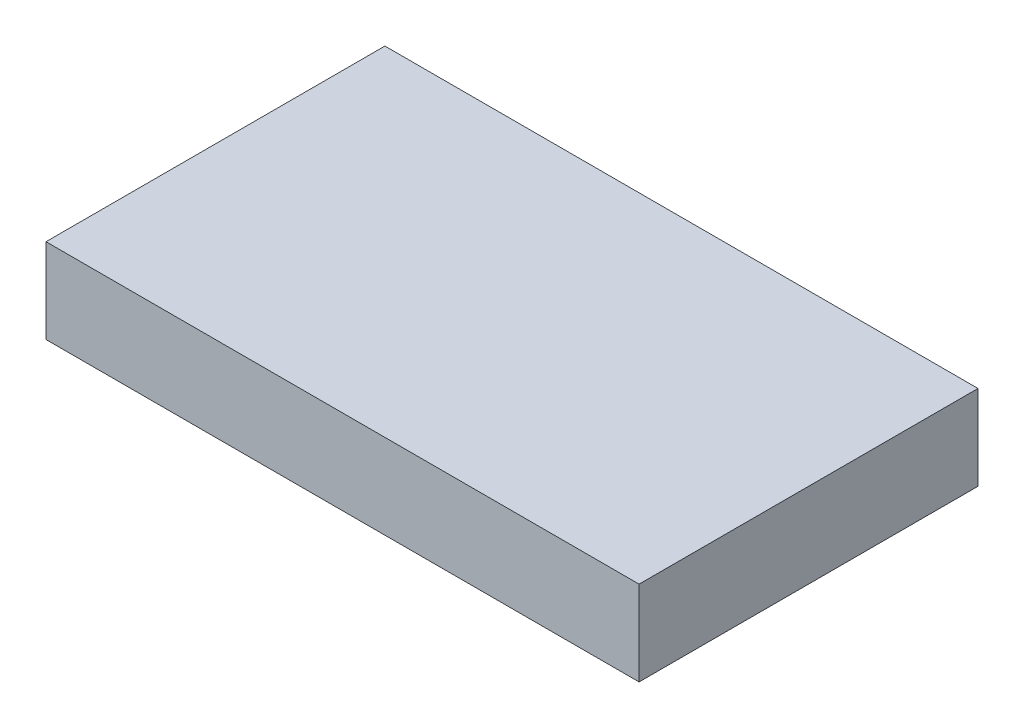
ISO-10303-21;
HEADER;
FILE_DESCRIPTION(('STEP AP214'),'2;1');
FILE_NAME('part.step','',(''),(''),'','','');
FILE_SCHEMA(('AUTOMOTIVE_DESIGN { 1 0 10303 214 1 1 1 1 }'));
ENDSEC;
DATA;
#1=APPLICATION_CONTEXT('core data for automotive mechanical design processes');
#2=APPLICATION_PROTOCOL_DEFINITION('international standard','automotive_design',2000,#1);
#3=PRODUCT_CONTEXT('',#1,'mechanical');
#4=PRODUCT('Part','Part','',(#3));
#5=PRODUCT_RELATED_PRODUCT_CATEGORY('part','',(#4));
#6=PRODUCT_DEFINITION_FORMATION('','',#4);
#7=PRODUCT_DEFINITION_CONTEXT('part definition',#1,'design');
#8=PRODUCT_DEFINITION('design','',#6,#7);
#9=PRODUCT_DEFINITION_SHAPE('','',#8);
#10=(LENGTH_UNIT() NAMED_UNIT(*) SI_UNIT(.MILLI.,.METRE.));
#11=(NAMED_UNIT(*) PLANE_ANGLE_UNIT() SI_UNIT($,.RADIAN.));
#12=(NAMED_UNIT(*) SI_UNIT($,.STERADIAN.) SOLID_ANGLE_UNIT());
#13=UNCERTAINTY_MEASURE_WITH_UNIT(LENGTH_MEASURE(1.E-05),#10,'distance_accuracy_value','');
#14=(GEOMETRIC_REPRESENTATION_CONTEXT(3) GLOBAL_UNCERTAINTY_ASSIGNED_CONTEXT((#13)) GLOBAL_UNIT_ASSIGNED_CONTEXT((#10,
#11,#12)) REPRESENTATION_CONTEXT('',''));
#15=CARTESIAN_POINT('',(0.,0.,0.));
#16=DIRECTION('',(0.,0.,1.));
#17=DIRECTION('',(1.,0.,0.));
#18=AXIS2_PLACEMENT_3D('',#15,#16,#17);
#19=CARTESIAN_POINT('',(-70.,20.,0.));
#20=DIRECTION('',(1.,0.,0.));
#21=DIRECTION('',(0.,0.,-1.));
#22=AXIS2_PLACEMENT_3D('',#19,#20,#21);
#23=PLANE('',#22);
#24=DIRECTION('',(0.,0.,1.));
#25=VECTOR('',#24,1.);
#26=CARTESIAN_POINT('',(-70.,0.,0.));
#27=LINE('',#26,#25);
#28=CARTESIAN_POINT('',(-70.,0.,0.));
#29=VERTEX_POINT('',#28);
#30=CARTESIAN_POINT('',(-70.,0.,80.));
#31=VERTEX_POINT('',#30);
#32=EDGE_CURVE('E94',#29,#31,#27,.T.);
#33=ORIENTED_EDGE('',*,*,#32,.T.);
#34=DIRECTION('',(0.,-1.,0.));
#35=VECTOR('',#34,1.);
#36=CARTESIAN_POINT('',(-70.,20.,80.));
#37=LINE('',#36,#35);
#38=CARTESIAN_POINT('',(-70.,20.,80.));
#39=VERTEX_POINT('',#38);
#40=EDGE_CURVE('E11',#39,#31,#37,.T.);
#41=ORIENTED_EDGE('',*,*,#40,.F.);
#42=DIRECTION('',(0.,0.,1.));
#43=VECTOR('',#42,1.);
#44=CARTESIAN_POINT('',(-70.,20.,0.));
#45=LINE('',#44,#43);
#46=CARTESIAN_POINT('',(-70.,20.,0.));
#47=VERTEX_POINT('',#46);
#48=EDGE_CURVE('E82',#47,#39,#45,.T.);
#49=ORIENTED_EDGE('',*,*,#48,.F.);
#50=DIRECTION('',(0.,-1.,0.));
#51=VECTOR('',#50,1.);
#52=CARTESIAN_POINT('',(-70.,20.,0.));
#53=LINE('',#52,#51);
#54=EDGE_CURVE('E90',#47,#29,#53,.T.);
#55=ORIENTED_EDGE('',*,*,#54,.T.);
#56=EDGE_LOOP('',(#33,#41,#49,#55));
#57=FACE_BOUND('',#56,.T.);
#58=ADVANCED_FACE('F31',(#57),#23,.F.);
#59=CARTESIAN_POINT('',(-70.,20.,80.));
#60=DIRECTION('',(0.,0.,-1.));
#61=DIRECTION('',(-1.,0.,0.));
#62=AXIS2_PLACEMENT_3D('',#59,#60,#61);
#63=PLANE('',#62);
#64=DIRECTION('',(1.,0.,0.));
#65=VECTOR('',#64,1.);
#66=CARTESIAN_POINT('',(-70.,0.,80.));
#67=LINE('',#66,#65);
#68=CARTESIAN_POINT('',(70.,0.,80.));
#69=VERTEX_POINT('',#68);
#70=EDGE_CURVE('E86',#31,#69,#67,.T.);
#71=ORIENTED_EDGE('',*,*,#70,.T.);
#72=DIRECTION('',(0.,-1.,0.));
#73=VECTOR('',#72,1.);
#74=CARTESIAN_POINT('',(70.,20.,80.));
#75=LINE('',#74,#73);
#76=CARTESIAN_POINT('',(70.,20.,80.));
#77=VERTEX_POINT('',#76);
#78=EDGE_CURVE('E39',#77,#69,#75,.T.);
#79=ORIENTED_EDGE('',*,*,#78,.F.);
#80=DIRECTION('',(1.,0.,0.));
#81=VECTOR('',#80,1.);
#82=CARTESIAN_POINT('',(-70.,20.,80.));
#83=LINE('',#82,#81);
#84=EDGE_CURVE('E77',#39,#77,#83,.T.);
#85=ORIENTED_EDGE('',*,*,#84,.F.);
#86=ORIENTED_EDGE('',*,*,#40,.T.);
#87=EDGE_LOOP('',(#71,#79,#85,#86));
#88=FACE_BOUND('',#87,.T.);
#89=ADVANCED_FACE('F85',(#88),#63,.F.);
#90=CARTESIAN_POINT('',(70.,20.,0.));
#91=DIRECTION('',(-1.,0.,0.));
#92=DIRECTION('',(0.,0.,1.));
#93=AXIS2_PLACEMENT_3D('',#90,#91,#92);
#94=PLANE('',#93);
#95=DIRECTION('',(0.,0.,-1.));
#96=VECTOR('',#95,1.);
#97=CARTESIAN_POINT('',(70.,0.,0.));
#98=LINE('',#97,#96);
#99=CARTESIAN_POINT('',(70.,0.,0.));
#100=VERTEX_POINT('',#99);
#101=EDGE_CURVE('E64',#69,#100,#98,.T.);
#102=ORIENTED_EDGE('',*,*,#101,.T.);
#103=DIRECTION('',(0.,-1.,0.));
#104=VECTOR('',#103,1.);
#105=CARTESIAN_POINT('',(70.,20.,0.));
#106=LINE('',#105,#104);
#107=CARTESIAN_POINT('',(70.,20.,0.));
#108=VERTEX_POINT('',#107);
#109=EDGE_CURVE('E87',#108,#100,#106,.T.);
#110=ORIENTED_EDGE('',*,*,#109,.F.);
#111=DIRECTION('',(0.,0.,-1.));
#112=VECTOR('',#111,1.);
#113=CARTESIAN_POINT('',(70.,20.,0.));
#114=LINE('',#113,#112);
#115=EDGE_CURVE('E80',#77,#108,#114,.T.);
#116=ORIENTED_EDGE('',*,*,#115,.F.);
#117=ORIENTED_EDGE('',*,*,#78,.T.);
#118=EDGE_LOOP('',(#102,#110,#116,#117));
#119=FACE_BOUND('',#118,.T.);
#120=ADVANCED_FACE('F88',(#119),#94,.F.);
#121=CARTESIAN_POINT('',(-70.,20.,0.));
#122=DIRECTION('',(0.,0.,1.));
#123=DIRECTION('',(1.,0.,0.));
#124=AXIS2_PLACEMENT_3D('',#121,#122,#123);
#125=PLANE('',#124);
#126=DIRECTION('',(-1.,0.,0.));
#127=VECTOR('',#126,1.);
#128=CARTESIAN_POINT('',(-70.,0.,0.));
#129=LINE('',#128,#127);
#130=EDGE_CURVE('E70',#100,#29,#129,.T.);
#131=ORIENTED_EDGE('',*,*,#130,.T.);
#132=ORIENTED_EDGE('',*,*,#54,.F.);
#133=DIRECTION('',(-1.,0.,0.));
#134=VECTOR('',#133,1.);
#135=CARTESIAN_POINT('',(-70.,20.,0.));
#136=LINE('',#135,#134);
#137=EDGE_CURVE('E47',#108,#47,#136,.T.);
#138=ORIENTED_EDGE('',*,*,#137,.F.);
#139=ORIENTED_EDGE('',*,*,#109,.T.);
#140=EDGE_LOOP('',(#131,#132,#138,#139));
#141=FACE_BOUND('',#140,.T.);
#142=ADVANCED_FACE('F101',(#141),#125,.F.);
#143=CARTESIAN_POINT('',(-70.,20.,0.));
#144=DIRECTION('',(0.,1.,0.));
#145=DIRECTION('',(0.,0.,1.));
#146=AXIS2_PLACEMENT_3D('',#143,#144,#145);
#147=PLANE('',#146);
#148=ORIENTED_EDGE('',*,*,#48,.T.);
#149=ORIENTED_EDGE('',*,*,#84,.T.);
#150=ORIENTED_EDGE('',*,*,#115,.T.);
#151=ORIENTED_EDGE('',*,*,#137,.T.);
#152=EDGE_LOOP('',(#148,#149,#150,#151));
#153=FACE_BOUND('',#152,.T.);
#154=ADVANCED_FACE('F78',(#153),#147,.T.);
#155=CARTESIAN_POINT('',(-70.,0.,0.));
#156=DIRECTION('',(0.,1.,0.));
#157=DIRECTION('',(0.,0.,1.));
#158=AXIS2_PLACEMENT_3D('',#155,#156,#157);
#159=PLANE('',#158);
#160=ORIENTED_EDGE('',*,*,#32,.F.);
#161=ORIENTED_EDGE('',*,*,#130,.F.);
#162=ORIENTED_EDGE('',*,*,#101,.F.);
#163=ORIENTED_EDGE('',*,*,#70,.F.);
#164=EDGE_LOOP('',(#160,#161,#162,#163));
#165=FACE_BOUND('',#164,.T.);
#166=ADVANCED_FACE('F104',(#165),#159,.F.);
#167=CLOSED_SHELL('',(#58,#89,#120,#142,#154,#166));
#168=MANIFOLD_SOLID_BREP('B2',#167);
#169=ADVANCED_BREP_SHAPE_REPRESENTATION('',(#18,#168),#14);
#170=SHAPE_DEFINITION_REPRESENTATION(#9,#169);
ENDSEC;
END-ISO-10303-21;
